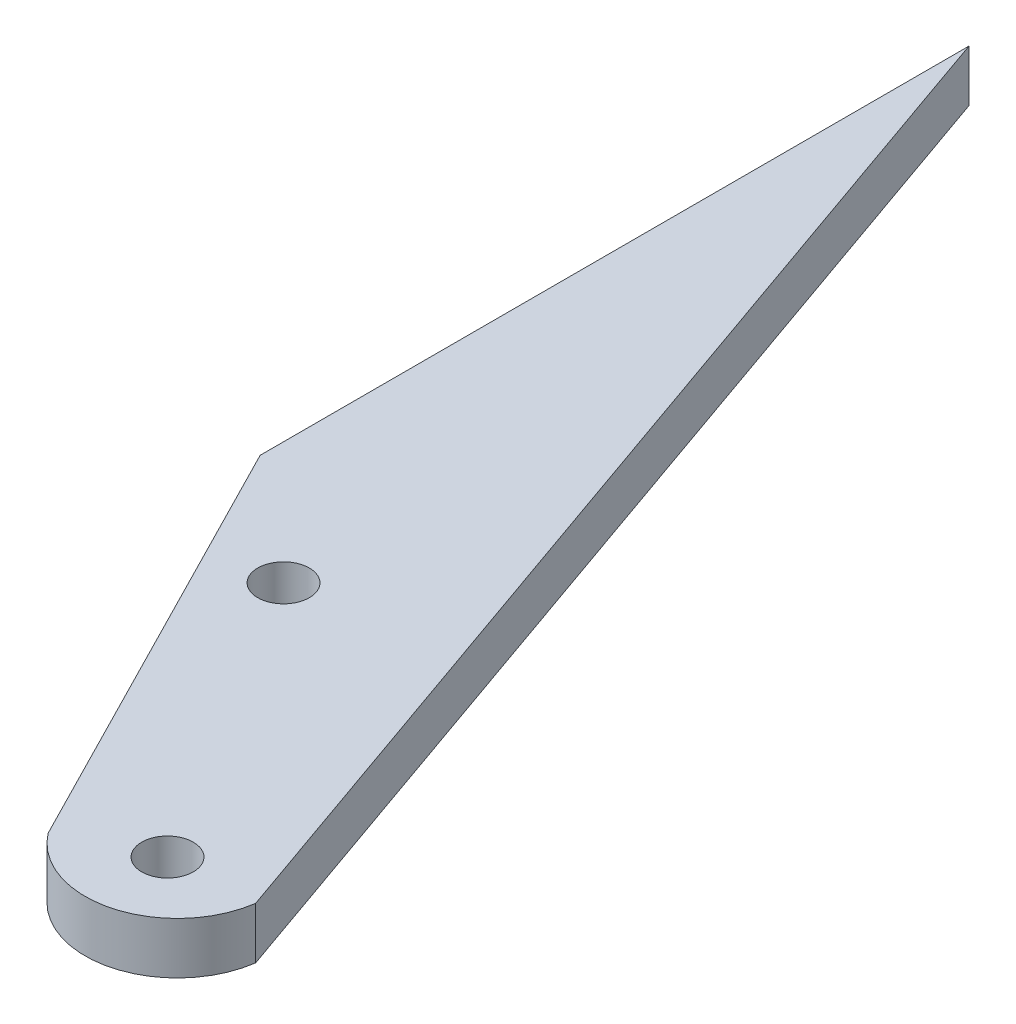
ISO-10303-21;
HEADER;
FILE_DESCRIPTION(('STEP AP214'),'2;1');
FILE_NAME('part.step','',(''),(''),'','','');
FILE_SCHEMA(('AUTOMOTIVE_DESIGN { 1 0 10303 214 1 1 1 1 }'));
ENDSEC;
DATA;
#1=APPLICATION_CONTEXT('core data for automotive mechanical design processes');
#2=APPLICATION_PROTOCOL_DEFINITION('international standard','automotive_design',2000,#1);
#3=PRODUCT_CONTEXT('',#1,'mechanical');
#4=PRODUCT('Part','Part','',(#3));
#5=PRODUCT_RELATED_PRODUCT_CATEGORY('part','',(#4));
#6=PRODUCT_DEFINITION_FORMATION('','',#4);
#7=PRODUCT_DEFINITION_CONTEXT('part definition',#1,'design');
#8=PRODUCT_DEFINITION('design','',#6,#7);
#9=PRODUCT_DEFINITION_SHAPE('','',#8);
#10=(LENGTH_UNIT() NAMED_UNIT(*) SI_UNIT(.MILLI.,.METRE.));
#11=(NAMED_UNIT(*) PLANE_ANGLE_UNIT() SI_UNIT($,.RADIAN.));
#12=(NAMED_UNIT(*) SI_UNIT($,.STERADIAN.) SOLID_ANGLE_UNIT());
#13=UNCERTAINTY_MEASURE_WITH_UNIT(LENGTH_MEASURE(1.E-05),#10,'distance_accuracy_value','');
#14=(GEOMETRIC_REPRESENTATION_CONTEXT(3) GLOBAL_UNCERTAINTY_ASSIGNED_CONTEXT((#13)) GLOBAL_UNIT_ASSIGNED_CONTEXT((#10,
#11,#12)) REPRESENTATION_CONTEXT('',''));
#15=CARTESIAN_POINT('',(0.,0.,0.));
#16=DIRECTION('',(0.,0.,1.));
#17=DIRECTION('',(1.,0.,0.));
#18=AXIS2_PLACEMENT_3D('',#15,#16,#17);
#19=CARTESIAN_POINT('',(-5.30816711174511,3.,-0.748327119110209));
#20=DIRECTION('',(0.,1.,0.));
#21=DIRECTION('',(0.,0.,1.));
#22=AXIS2_PLACEMENT_3D('',#19,#20,#21);
#23=PLANE('',#22);
#24=CARTESIAN_POINT('',(-15.3364804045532,3.,-16.9587094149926));
#25=DIRECTION('',(0.,1.,0.));
#26=DIRECTION('',(0.,0.,1.));
#27=AXIS2_PLACEMENT_3D('',#24,#25,#26);
#28=CIRCLE('',#27,1.5);
#29=CARTESIAN_POINT('',(-15.3364804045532,3.,-15.4587094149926));
#30=VERTEX_POINT('',#29);
#31=EDGE_CURVE('E108',#30,#30,#28,.T.);
#32=ORIENTED_EDGE('',*,*,#31,.F.);
#33=EDGE_LOOP('',(#32));
#34=FACE_BOUND('',#33,.T.);
#35=DIRECTION('',(-0.331173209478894,0.,-0.94356997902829));
#36=VECTOR('',#35,1.);
#37=CARTESIAN_POINT('',(-22.4436084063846,3.,-63.9457374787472));
#38=LINE('',#37,#36);
#39=CARTESIAN_POINT('',(0.,3.,0.));
#40=VERTEX_POINT('',#39);
#41=CARTESIAN_POINT('',(-22.4436084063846,3.,-63.9457374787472));
#42=VERTEX_POINT('',#41);
#43=EDGE_CURVE('E93',#40,#42,#38,.T.);
#44=ORIENTED_EDGE('',*,*,#43,.T.);
#45=DIRECTION('',(0.,0.,1.));
#46=VECTOR('',#45,1.);
#47=CARTESIAN_POINT('',(-22.4436084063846,3.,-63.9457374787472));
#48=LINE('',#47,#46);
#49=CARTESIAN_POINT('',(-22.4436084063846,3.,-22.7057374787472));
#50=VERTEX_POINT('',#49);
#51=EDGE_CURVE('E88',#42,#50,#48,.T.);
#52=ORIENTED_EDGE('',*,*,#51,.T.);
#53=DIRECTION('',(0.454767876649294,0.,0.890610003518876));
#54=VECTOR('',#53,1.);
#55=CARTESIAN_POINT('',(-22.4436084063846,3.,-22.7057374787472));
#56=LINE('',#55,#54);
#57=CARTESIAN_POINT('',(-9.57367749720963,3.,2.49852562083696));
#58=VERTEX_POINT('',#57);
#59=EDGE_CURVE('E91',#50,#58,#56,.T.);
#60=ORIENTED_EDGE('',*,*,#59,.T.);
#61=CARTESIAN_POINT('',(-5.30816711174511,3.,-0.748327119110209));
#62=DIRECTION('',(0.,1.,0.));
#63=DIRECTION('',(0.,0.,1.));
#64=AXIS2_PLACEMENT_3D('',#61,#62,#63);
#65=CIRCLE('',#64,5.36065588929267);
#66=EDGE_CURVE('E58',#58,#40,#65,.T.);
#67=ORIENTED_EDGE('',*,*,#66,.T.);
#68=EDGE_LOOP('',(#44,#52,#60,#67));
#69=FACE_BOUND('',#68,.T.);
#70=CARTESIAN_POINT('',(-4.89794958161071,3.,0.229925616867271));
#71=DIRECTION('',(0.,1.,0.));
#72=DIRECTION('',(0.,0.,1.));
#73=AXIS2_PLACEMENT_3D('',#70,#71,#72);
#74=CIRCLE('',#73,1.5);
#75=CARTESIAN_POINT('',(-4.89794958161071,3.,1.72992561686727));
#76=VERTEX_POINT('',#75);
#77=EDGE_CURVE('E123',#76,#76,#74,.T.);
#78=ORIENTED_EDGE('',*,*,#77,.F.);
#79=EDGE_LOOP('',(#78));
#80=FACE_BOUND('',#79,.T.);
#81=ADVANCED_FACE('F41',(#34,#69,#80),#23,.T.);
#82=CARTESIAN_POINT('',(-5.30816711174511,0.,-0.748327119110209));
#83=DIRECTION('',(0.,1.,0.));
#84=DIRECTION('',(0.,0.,1.));
#85=AXIS2_PLACEMENT_3D('',#82,#83,#84);
#86=PLANE('',#85);
#87=DIRECTION('',(-0.331173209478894,0.,-0.94356997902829));
#88=VECTOR('',#87,1.);
#89=CARTESIAN_POINT('',(-22.4436084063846,0.,-63.9457374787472));
#90=LINE('',#89,#88);
#91=CARTESIAN_POINT('',(0.,0.,0.));
#92=VERTEX_POINT('',#91);
#93=CARTESIAN_POINT('',(-22.4436084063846,0.,-63.9457374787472));
#94=VERTEX_POINT('',#93);
#95=EDGE_CURVE('E105',#92,#94,#90,.T.);
#96=ORIENTED_EDGE('',*,*,#95,.F.);
#97=CARTESIAN_POINT('',(-5.30816711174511,0.,-0.748327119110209));
#98=DIRECTION('',(0.,1.,0.));
#99=DIRECTION('',(0.,0.,1.));
#100=AXIS2_PLACEMENT_3D('',#97,#98,#99);
#101=CIRCLE('',#100,5.36065588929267);
#102=CARTESIAN_POINT('',(-9.57367749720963,0.,2.49852562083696));
#103=VERTEX_POINT('',#102);
#104=EDGE_CURVE('E81',#103,#92,#101,.T.);
#105=ORIENTED_EDGE('',*,*,#104,.F.);
#106=DIRECTION('',(0.454767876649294,0.,0.890610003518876));
#107=VECTOR('',#106,1.);
#108=CARTESIAN_POINT('',(-22.4436084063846,0.,-22.7057374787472));
#109=LINE('',#108,#107);
#110=CARTESIAN_POINT('',(-22.4436084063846,0.,-22.7057374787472));
#111=VERTEX_POINT('',#110);
#112=EDGE_CURVE('E75',#111,#103,#109,.T.);
#113=ORIENTED_EDGE('',*,*,#112,.F.);
#114=DIRECTION('',(0.,0.,1.));
#115=VECTOR('',#114,1.);
#116=CARTESIAN_POINT('',(-22.4436084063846,0.,-63.9457374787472));
#117=LINE('',#116,#115);
#118=EDGE_CURVE('E97',#94,#111,#117,.T.);
#119=ORIENTED_EDGE('',*,*,#118,.F.);
#120=EDGE_LOOP('',(#96,#105,#113,#119));
#121=FACE_BOUND('',#120,.T.);
#122=CARTESIAN_POINT('',(-15.3364804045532,0.,-16.9587094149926));
#123=DIRECTION('',(0.,1.,0.));
#124=DIRECTION('',(0.,0.,1.));
#125=AXIS2_PLACEMENT_3D('',#122,#123,#124);
#126=CIRCLE('',#125,1.5);
#127=CARTESIAN_POINT('',(-15.3364804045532,0.,-15.4587094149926));
#128=VERTEX_POINT('',#127);
#129=EDGE_CURVE('E120',#128,#128,#126,.T.);
#130=ORIENTED_EDGE('',*,*,#129,.T.);
#131=EDGE_LOOP('',(#130));
#132=FACE_BOUND('',#131,.T.);
#133=CARTESIAN_POINT('',(-4.89794958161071,0.,0.229925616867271));
#134=DIRECTION('',(0.,1.,0.));
#135=DIRECTION('',(0.,0.,1.));
#136=AXIS2_PLACEMENT_3D('',#133,#134,#135);
#137=CIRCLE('',#136,1.5);
#138=CARTESIAN_POINT('',(-4.89794958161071,0.,1.72992561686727));
#139=VERTEX_POINT('',#138);
#140=EDGE_CURVE('E126',#139,#139,#137,.T.);
#141=ORIENTED_EDGE('',*,*,#140,.T.);
#142=EDGE_LOOP('',(#141));
#143=FACE_BOUND('',#142,.T.);
#144=ADVANCED_FACE('F116',(#121,#132,#143),#86,.F.);
#145=CARTESIAN_POINT('',(-22.4436084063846,3.,-63.9457374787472));
#146=DIRECTION('',(-0.943569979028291,0.,0.331173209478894));
#147=DIRECTION('',(0.331173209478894,0.,0.943569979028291));
#148=AXIS2_PLACEMENT_3D('',#145,#146,#147);
#149=PLANE('',#148);
#150=ORIENTED_EDGE('',*,*,#95,.T.);
#151=DIRECTION('',(0.,-1.,0.));
#152=VECTOR('',#151,1.);
#153=CARTESIAN_POINT('',(-22.4436084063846,3.,-63.9457374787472));
#154=LINE('',#153,#152);
#155=EDGE_CURVE('E11',#42,#94,#154,.T.);
#156=ORIENTED_EDGE('',*,*,#155,.F.);
#157=ORIENTED_EDGE('',*,*,#43,.F.);
#158=DIRECTION('',(0.,-1.,0.));
#159=VECTOR('',#158,1.);
#160=CARTESIAN_POINT('',(0.,3.,0.));
#161=LINE('',#160,#159);
#162=EDGE_CURVE('E101',#40,#92,#161,.T.);
#163=ORIENTED_EDGE('',*,*,#162,.T.);
#164=EDGE_LOOP('',(#150,#156,#157,#163));
#165=FACE_BOUND('',#164,.T.);
#166=ADVANCED_FACE('F43',(#165),#149,.F.);
#167=CARTESIAN_POINT('',(-22.4436084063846,3.,-63.9457374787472));
#168=DIRECTION('',(1.,0.,0.));
#169=DIRECTION('',(0.,0.,-1.));
#170=AXIS2_PLACEMENT_3D('',#167,#168,#169);
#171=PLANE('',#170);
#172=ORIENTED_EDGE('',*,*,#118,.T.);
#173=DIRECTION('',(0.,-1.,0.));
#174=VECTOR('',#173,1.);
#175=CARTESIAN_POINT('',(-22.4436084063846,3.,-22.7057374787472));
#176=LINE('',#175,#174);
#177=EDGE_CURVE('E50',#50,#111,#176,.T.);
#178=ORIENTED_EDGE('',*,*,#177,.F.);
#179=ORIENTED_EDGE('',*,*,#51,.F.);
#180=ORIENTED_EDGE('',*,*,#155,.T.);
#181=EDGE_LOOP('',(#172,#178,#179,#180));
#182=FACE_BOUND('',#181,.T.);
#183=ADVANCED_FACE('F96',(#182),#171,.F.);
#184=CARTESIAN_POINT('',(-22.4436084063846,3.,-22.7057374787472));
#185=DIRECTION('',(0.890610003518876,0.,-0.454767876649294));
#186=DIRECTION('',(-0.454767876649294,0.,-0.890610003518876));
#187=AXIS2_PLACEMENT_3D('',#184,#185,#186);
#188=PLANE('',#187);
#189=ORIENTED_EDGE('',*,*,#112,.T.);
#190=DIRECTION('',(0.,-1.,0.));
#191=VECTOR('',#190,1.);
#192=CARTESIAN_POINT('',(-9.57367749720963,3.,2.49852562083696));
#193=LINE('',#192,#191);
#194=EDGE_CURVE('E98',#58,#103,#193,.T.);
#195=ORIENTED_EDGE('',*,*,#194,.F.);
#196=ORIENTED_EDGE('',*,*,#59,.F.);
#197=ORIENTED_EDGE('',*,*,#177,.T.);
#198=EDGE_LOOP('',(#189,#195,#196,#197));
#199=FACE_BOUND('',#198,.T.);
#200=ADVANCED_FACE('F99',(#199),#188,.F.);
#201=CARTESIAN_POINT('',(-5.30816711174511,3.,-0.748327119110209));
#202=DIRECTION('',(0.,-1.,0.));
#203=DIRECTION('',(0.,0.,-1.));
#204=AXIS2_PLACEMENT_3D('',#201,#202,#203);
#205=CYLINDRICAL_SURFACE('',#204,5.36065588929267);
#206=ORIENTED_EDGE('',*,*,#104,.T.);
#207=ORIENTED_EDGE('',*,*,#162,.F.);
#208=ORIENTED_EDGE('',*,*,#66,.F.);
#209=ORIENTED_EDGE('',*,*,#194,.T.);
#210=EDGE_LOOP('',(#206,#207,#208,#209));
#211=FACE_BOUND('',#210,.T.);
#212=ADVANCED_FACE('F113',(#211),#205,.T.);
#213=CARTESIAN_POINT('',(-15.3364804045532,3.,-16.9587094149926));
#214=DIRECTION('',(0.,-1.,0.));
#215=DIRECTION('',(0.,0.,-1.));
#216=AXIS2_PLACEMENT_3D('',#213,#214,#215);
#217=CYLINDRICAL_SURFACE('',#216,1.5);
#218=ORIENTED_EDGE('',*,*,#31,.T.);
#219=EDGE_LOOP('',(#218));
#220=FACE_BOUND('',#219,.T.);
#221=ORIENTED_EDGE('',*,*,#129,.F.);
#222=EDGE_LOOP('',(#221));
#223=FACE_BOUND('',#222,.T.);
#224=ADVANCED_FACE('F143',(#220,#223),#217,.F.);
#225=CARTESIAN_POINT('',(-4.89794958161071,3.,0.229925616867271));
#226=DIRECTION('',(0.,-1.,0.));
#227=DIRECTION('',(0.,0.,-1.));
#228=AXIS2_PLACEMENT_3D('',#225,#226,#227);
#229=CYLINDRICAL_SURFACE('',#228,1.5);
#230=ORIENTED_EDGE('',*,*,#77,.T.);
#231=EDGE_LOOP('',(#230));
#232=FACE_BOUND('',#231,.T.);
#233=ORIENTED_EDGE('',*,*,#140,.F.);
#234=EDGE_LOOP('',(#233));
#235=FACE_BOUND('',#234,.T.);
#236=ADVANCED_FACE('F132',(#232,#235),#229,.F.);
#237=CLOSED_SHELL('',(#81,#144,#166,#183,#200,#212,#224,#236));
#238=MANIFOLD_SOLID_BREP('B2',#237);
#239=ADVANCED_BREP_SHAPE_REPRESENTATION('',(#18,#238),#14);
#240=SHAPE_DEFINITION_REPRESENTATION(#9,#239);
ENDSEC;
END-ISO-10303-21;
